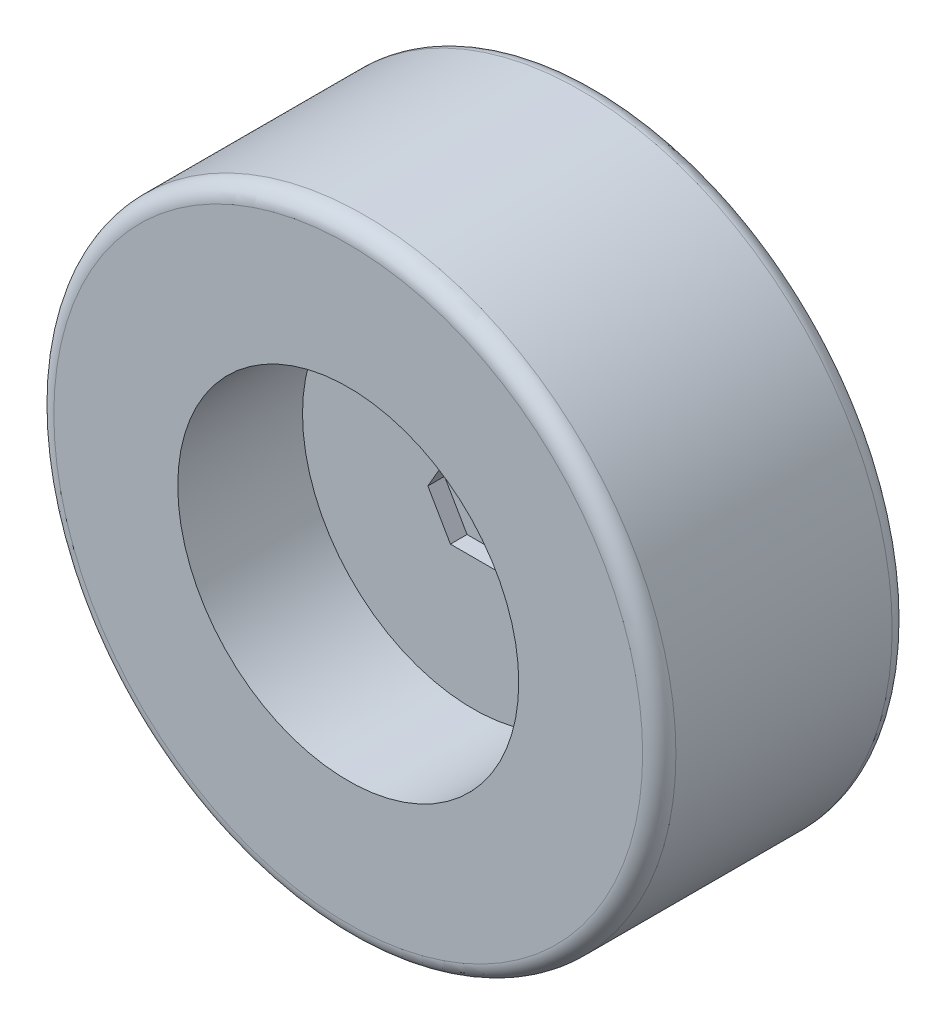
from build123d import *

# Parameters (mm, degrees)
SKETCH1_R           = 47.498
BOSS_EXTRUDE1_DEPTH = 38.1
SKETCH2_R           = 26.035
CUT_EXTRUDE1_DEPTH  = 19.05
CUT_EXTRUDE2_START  = -6.35
SKETCH3_R           = 26.035
CUT_EXTRUDE2_DEPTH  = 6.35
CUT_EXTRUDE3_DEPTH  = 2.54
SKETCH5_R           = 1.5875
CUT_EXTRUDE4_DEPTH  = 75.297930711
FILLET1_R           = 2.54


with BuildPart() as part:
    # Sketch1 → Boss-Extrude1 (new body)
    with BuildSketch(Plane.XY):
        with Locations(Location((0, 0, 0), (0, 0, 180))):
            Circle(SKETCH1_R)
    extrude(amount=BOSS_EXTRUDE1_DEPTH)

    # Sketch2 → Cut-Extrude1 (cut)
    with BuildSketch(Plane.XY.offset(38.1)):
        Circle(SKETCH2_R)
    extrude(amount=-CUT_EXTRUDE1_DEPTH, mode=Mode.SUBTRACT)

    # Sketch3 → Cut-Extrude2 (cut)
    with BuildSketch(Plane(origin=(0, 0, 0), x_dir=(-1, 0, 0), z_dir=(0, 0, -1)).offset(CUT_EXTRUDE2_START)):
        with Locations(Location((0, 0, 0), (0, 0, 180))):
            Circle(SKETCH3_R)
    extrude(amount=CUT_EXTRUDE2_DEPTH, mode=Mode.SUBTRACT)

    # Sketch4 → Cut-Extrude3 (cut)
    with BuildSketch(Plane.XY.offset(19.05)):
        Polygon((6.892407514, 0), (3.446203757, 5.969), (-3.446203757, 5.969), (-6.892407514, 0), (-3.446203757, -5.969), (3.446203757, -5.969), align=None)
    extrude(amount=-CUT_EXTRUDE3_DEPTH, mode=Mode.SUBTRACT)

    # Sketch5 → Cut-Extrude4 (cut, through all)
    with BuildSketch(Plane(origin=(0, 0, 6.35), x_dir=(-1, 0, 0), z_dir=(0, 0, -1))):
        Circle(SKETCH5_R)
    extrude(amount=-CUT_EXTRUDE4_DEPTH, mode=Mode.SUBTRACT)

    # Fillet1
    fillet1_edges = [part.edges().sort_by_distance(p)[0] for p in [
        (47.498, 0, 0),
        (47.498, 0, 38.1),
    ]]
    fillet(fillet1_edges, radius=FILLET1_R)


solid = part.part
